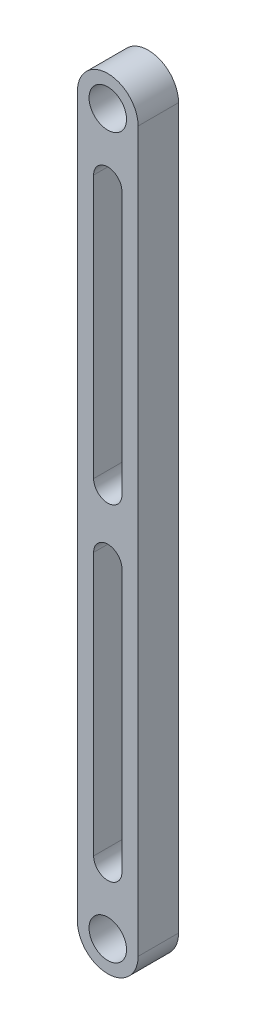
ISO-10303-21;
HEADER;
FILE_DESCRIPTION(('STEP AP214'),'2;1');
FILE_NAME('part.step','',(''),(''),'','','');
FILE_SCHEMA(('AUTOMOTIVE_DESIGN { 1 0 10303 214 1 1 1 1 }'));
ENDSEC;
DATA;
#1=APPLICATION_CONTEXT('core data for automotive mechanical design processes');
#2=APPLICATION_PROTOCOL_DEFINITION('international standard','automotive_design',2000,#1);
#3=PRODUCT_CONTEXT('',#1,'mechanical');
#4=PRODUCT('Part','Part','',(#3));
#5=PRODUCT_RELATED_PRODUCT_CATEGORY('part','',(#4));
#6=PRODUCT_DEFINITION_FORMATION('','',#4);
#7=PRODUCT_DEFINITION_CONTEXT('part definition',#1,'design');
#8=PRODUCT_DEFINITION('design','',#6,#7);
#9=PRODUCT_DEFINITION_SHAPE('','',#8);
#10=(LENGTH_UNIT() NAMED_UNIT(*) SI_UNIT(.MILLI.,.METRE.));
#11=(NAMED_UNIT(*) PLANE_ANGLE_UNIT() SI_UNIT($,.RADIAN.));
#12=(NAMED_UNIT(*) SI_UNIT($,.STERADIAN.) SOLID_ANGLE_UNIT());
#13=UNCERTAINTY_MEASURE_WITH_UNIT(LENGTH_MEASURE(1.E-05),#10,'distance_accuracy_value','');
#14=(GEOMETRIC_REPRESENTATION_CONTEXT(3) GLOBAL_UNCERTAINTY_ASSIGNED_CONTEXT((#13)) GLOBAL_UNIT_ASSIGNED_CONTEXT((#10,
#11,#12)) REPRESENTATION_CONTEXT('',''));
#15=CARTESIAN_POINT('',(0.,0.,0.));
#16=DIRECTION('',(0.,0.,1.));
#17=DIRECTION('',(1.,0.,0.));
#18=AXIS2_PLACEMENT_3D('',#15,#16,#17);
#19=CARTESIAN_POINT('',(0.,-88.9,10.));
#20=DIRECTION('',(0.,0.,1.));
#21=DIRECTION('',(1.,0.,0.));
#22=AXIS2_PLACEMENT_3D('',#19,#20,#21);
#23=PLANE('',#22);
#24=CARTESIAN_POINT('',(0.,-88.9,10.));
#25=DIRECTION('',(0.,0.,1.));
#26=DIRECTION('',(1.,0.,0.));
#27=AXIS2_PLACEMENT_3D('',#24,#25,#26);
#28=CIRCLE('',#27,4.635);
#29=CARTESIAN_POINT('',(4.635,-88.9,10.));
#30=VERTEX_POINT('',#29);
#31=EDGE_CURVE('E196',#30,#30,#28,.T.);
#32=ORIENTED_EDGE('',*,*,#31,.F.);
#33=EDGE_LOOP('',(#32));
#34=FACE_BOUND('',#33,.T.);
#35=CARTESIAN_POINT('',(0.,-88.9,10.));
#36=DIRECTION('',(0.,0.,1.));
#37=DIRECTION('',(1.,0.,0.));
#38=AXIS2_PLACEMENT_3D('',#35,#36,#37);
#39=CIRCLE('',#38,7.5);
#40=CARTESIAN_POINT('',(-7.5,-88.9,10.));
#41=VERTEX_POINT('',#40);
#42=CARTESIAN_POINT('',(7.5,-88.9,10.));
#43=VERTEX_POINT('',#42);
#44=EDGE_CURVE('E202',#41,#43,#39,.T.);
#45=ORIENTED_EDGE('',*,*,#44,.T.);
#46=DIRECTION('',(0.,1.,0.));
#47=VECTOR('',#46,1.);
#48=CARTESIAN_POINT('',(7.5,-88.9,10.));
#49=LINE('',#48,#47);
#50=CARTESIAN_POINT('',(7.5,88.9,10.));
#51=VERTEX_POINT('',#50);
#52=EDGE_CURVE('E205',#43,#51,#49,.T.);
#53=ORIENTED_EDGE('',*,*,#52,.T.);
#54=CARTESIAN_POINT('',(0.,88.9,10.));
#55=DIRECTION('',(0.,0.,1.));
#56=DIRECTION('',(1.,0.,0.));
#57=AXIS2_PLACEMENT_3D('',#54,#55,#56);
#58=CIRCLE('',#57,7.5);
#59=CARTESIAN_POINT('',(-7.50000000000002,88.9,10.));
#60=VERTEX_POINT('',#59);
#61=EDGE_CURVE('E208',#51,#60,#58,.T.);
#62=ORIENTED_EDGE('',*,*,#61,.T.);
#63=DIRECTION('',(0.,-1.,0.));
#64=VECTOR('',#63,1.);
#65=CARTESIAN_POINT('',(-7.5,-88.9,10.));
#66=LINE('',#65,#64);
#67=EDGE_CURVE('E210',#60,#41,#66,.T.);
#68=ORIENTED_EDGE('',*,*,#67,.T.);
#69=EDGE_LOOP('',(#45,#53,#62,#68));
#70=FACE_BOUND('',#69,.T.);
#71=CARTESIAN_POINT('',(0.,88.9,10.));
#72=DIRECTION('',(0.,0.,1.));
#73=DIRECTION('',(1.,0.,0.));
#74=AXIS2_PLACEMENT_3D('',#71,#72,#73);
#75=CIRCLE('',#74,4.635);
#76=CARTESIAN_POINT('',(4.635,88.9,10.));
#77=VERTEX_POINT('',#76);
#78=EDGE_CURVE('E190',#77,#77,#75,.T.);
#79=ORIENTED_EDGE('',*,*,#78,.F.);
#80=EDGE_LOOP('',(#79));
#81=FACE_BOUND('',#80,.T.);
#82=DIRECTION('',(0.,1.,0.));
#83=VECTOR('',#82,1.);
#84=CARTESIAN_POINT('',(3.50000000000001,-72.9,10.));
#85=LINE('',#84,#83);
#86=CARTESIAN_POINT('',(3.50000000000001,-72.9,10.));
#87=VERTEX_POINT('',#86);
#88=CARTESIAN_POINT('',(3.49999999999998,-7.89999999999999,10.));
#89=VERTEX_POINT('',#88);
#90=EDGE_CURVE('E161',#87,#89,#85,.T.);
#91=ORIENTED_EDGE('',*,*,#90,.F.);
#92=CARTESIAN_POINT('',(0.,-72.9,10.));
#93=DIRECTION('',(0.,0.,1.));
#94=DIRECTION('',(1.,0.,0.));
#95=AXIS2_PLACEMENT_3D('',#92,#93,#94);
#96=CIRCLE('',#95,3.5);
#97=CARTESIAN_POINT('',(-3.49999999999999,-72.9,10.));
#98=VERTEX_POINT('',#97);
#99=EDGE_CURVE('E159',#98,#87,#96,.T.);
#100=ORIENTED_EDGE('',*,*,#99,.F.);
#101=DIRECTION('',(0.,-1.,0.));
#102=VECTOR('',#101,1.);
#103=CARTESIAN_POINT('',(-3.49999999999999,-72.9,10.));
#104=LINE('',#103,#102);
#105=CARTESIAN_POINT('',(-3.49999999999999,-7.90000000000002,10.));
#106=VERTEX_POINT('',#105);
#107=EDGE_CURVE('E167',#106,#98,#104,.T.);
#108=ORIENTED_EDGE('',*,*,#107,.F.);
#109=CARTESIAN_POINT('',(0.,-7.90000000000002,10.));
#110=DIRECTION('',(0.,0.,1.));
#111=DIRECTION('',(1.,0.,0.));
#112=AXIS2_PLACEMENT_3D('',#109,#110,#111);
#113=CIRCLE('',#112,3.5);
#114=EDGE_CURVE('E164',#89,#106,#113,.T.);
#115=ORIENTED_EDGE('',*,*,#114,.F.);
#116=EDGE_LOOP('',(#91,#100,#108,#115));
#117=FACE_BOUND('',#116,.T.);
#118=DIRECTION('',(0.,-1.,0.));
#119=VECTOR('',#118,1.);
#120=CARTESIAN_POINT('',(-3.5,72.9,10.));
#121=LINE('',#120,#119);
#122=CARTESIAN_POINT('',(-3.5,72.9,10.));
#123=VERTEX_POINT('',#122);
#124=CARTESIAN_POINT('',(-3.50000000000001,7.9,10.));
#125=VERTEX_POINT('',#124);
#126=EDGE_CURVE('E131',#123,#125,#121,.T.);
#127=ORIENTED_EDGE('',*,*,#126,.F.);
#128=CARTESIAN_POINT('',(0.,72.9,10.));
#129=DIRECTION('',(0.,0.,1.));
#130=DIRECTION('',(1.,0.,0.));
#131=AXIS2_PLACEMENT_3D('',#128,#129,#130);
#132=CIRCLE('',#131,3.50000000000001);
#133=CARTESIAN_POINT('',(3.50000000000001,72.9,10.));
#134=VERTEX_POINT('',#133);
#135=EDGE_CURVE('E123',#134,#123,#132,.T.);
#136=ORIENTED_EDGE('',*,*,#135,.F.);
#137=DIRECTION('',(0.,1.,0.));
#138=VECTOR('',#137,1.);
#139=CARTESIAN_POINT('',(3.50000000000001,72.9,10.));
#140=LINE('',#139,#138);
#141=CARTESIAN_POINT('',(3.50000000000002,7.9,10.));
#142=VERTEX_POINT('',#141);
#143=EDGE_CURVE('E145',#142,#134,#140,.T.);
#144=ORIENTED_EDGE('',*,*,#143,.F.);
#145=CARTESIAN_POINT('',(0.,7.9,10.));
#146=DIRECTION('',(0.,0.,1.));
#147=DIRECTION('',(1.,0.,0.));
#148=AXIS2_PLACEMENT_3D('',#145,#146,#147);
#149=CIRCLE('',#148,3.50000000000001);
#150=EDGE_CURVE('E143',#125,#142,#149,.T.);
#151=ORIENTED_EDGE('',*,*,#150,.F.);
#152=EDGE_LOOP('',(#127,#136,#144,#151));
#153=FACE_BOUND('',#152,.T.);
#154=ADVANCED_FACE('F34',(#34,#70,#81,#117,#153),#23,.T.);
#155=CARTESIAN_POINT('',(0.,-88.9,0.));
#156=DIRECTION('',(0.,0.,1.));
#157=DIRECTION('',(1.,0.,0.));
#158=AXIS2_PLACEMENT_3D('',#155,#156,#157);
#159=PLANE('',#158);
#160=CARTESIAN_POINT('',(0.,-72.9,0.));
#161=DIRECTION('',(0.,0.,1.));
#162=DIRECTION('',(1.,0.,0.));
#163=AXIS2_PLACEMENT_3D('',#160,#161,#162);
#164=CIRCLE('',#163,3.5);
#165=CARTESIAN_POINT('',(-3.49999999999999,-72.9,0.));
#166=VERTEX_POINT('',#165);
#167=CARTESIAN_POINT('',(3.50000000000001,-72.9,0.));
#168=VERTEX_POINT('',#167);
#169=EDGE_CURVE('E139',#166,#168,#164,.T.);
#170=ORIENTED_EDGE('',*,*,#169,.T.);
#171=DIRECTION('',(0.,1.,0.));
#172=VECTOR('',#171,1.);
#173=CARTESIAN_POINT('',(3.50000000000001,-72.9,0.));
#174=LINE('',#173,#172);
#175=CARTESIAN_POINT('',(3.49999999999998,-7.89999999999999,0.));
#176=VERTEX_POINT('',#175);
#177=EDGE_CURVE('E172',#168,#176,#174,.T.);
#178=ORIENTED_EDGE('',*,*,#177,.T.);
#179=CARTESIAN_POINT('',(0.,-7.90000000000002,0.));
#180=DIRECTION('',(0.,0.,1.));
#181=DIRECTION('',(1.,0.,0.));
#182=AXIS2_PLACEMENT_3D('',#179,#180,#181);
#183=CIRCLE('',#182,3.5);
#184=CARTESIAN_POINT('',(-3.49999999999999,-7.90000000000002,0.));
#185=VERTEX_POINT('',#184);
#186=EDGE_CURVE('E175',#176,#185,#183,.T.);
#187=ORIENTED_EDGE('',*,*,#186,.T.);
#188=DIRECTION('',(0.,-1.,0.));
#189=VECTOR('',#188,1.);
#190=CARTESIAN_POINT('',(-3.49999999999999,-72.9,0.));
#191=LINE('',#190,#189);
#192=EDGE_CURVE('E162',#185,#166,#191,.T.);
#193=ORIENTED_EDGE('',*,*,#192,.T.);
#194=EDGE_LOOP('',(#170,#178,#187,#193));
#195=FACE_BOUND('',#194,.T.);
#196=CARTESIAN_POINT('',(0.,-88.9,0.));
#197=DIRECTION('',(0.,0.,1.));
#198=DIRECTION('',(1.,0.,0.));
#199=AXIS2_PLACEMENT_3D('',#196,#197,#198);
#200=CIRCLE('',#199,7.5);
#201=CARTESIAN_POINT('',(-7.5,-88.9,0.));
#202=VERTEX_POINT('',#201);
#203=CARTESIAN_POINT('',(7.5,-88.9,0.));
#204=VERTEX_POINT('',#203);
#205=EDGE_CURVE('E199',#202,#204,#200,.T.);
#206=ORIENTED_EDGE('',*,*,#205,.F.);
#207=DIRECTION('',(0.,-1.,0.));
#208=VECTOR('',#207,1.);
#209=CARTESIAN_POINT('',(-7.5,-88.9,0.));
#210=LINE('',#209,#208);
#211=CARTESIAN_POINT('',(-7.50000000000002,88.9,0.));
#212=VERTEX_POINT('',#211);
#213=EDGE_CURVE('E206',#212,#202,#210,.T.);
#214=ORIENTED_EDGE('',*,*,#213,.F.);
#215=CARTESIAN_POINT('',(0.,88.9,0.));
#216=DIRECTION('',(0.,0.,1.));
#217=DIRECTION('',(1.,0.,0.));
#218=AXIS2_PLACEMENT_3D('',#215,#216,#217);
#219=CIRCLE('',#218,7.5);
#220=CARTESIAN_POINT('',(7.5,88.9,0.));
#221=VERTEX_POINT('',#220);
#222=EDGE_CURVE('E217',#221,#212,#219,.T.);
#223=ORIENTED_EDGE('',*,*,#222,.F.);
#224=DIRECTION('',(0.,1.,0.));
#225=VECTOR('',#224,1.);
#226=CARTESIAN_POINT('',(7.5,-88.9,0.));
#227=LINE('',#226,#225);
#228=EDGE_CURVE('E215',#204,#221,#227,.T.);
#229=ORIENTED_EDGE('',*,*,#228,.F.);
#230=EDGE_LOOP('',(#206,#214,#223,#229));
#231=FACE_BOUND('',#230,.T.);
#232=CARTESIAN_POINT('',(0.,-88.9,0.));
#233=DIRECTION('',(0.,0.,1.));
#234=DIRECTION('',(1.,0.,0.));
#235=AXIS2_PLACEMENT_3D('',#232,#233,#234);
#236=CIRCLE('',#235,4.635);
#237=CARTESIAN_POINT('',(4.635,-88.9,0.));
#238=VERTEX_POINT('',#237);
#239=EDGE_CURVE('E193',#238,#238,#236,.T.);
#240=ORIENTED_EDGE('',*,*,#239,.T.);
#241=EDGE_LOOP('',(#240));
#242=FACE_BOUND('',#241,.T.);
#243=CARTESIAN_POINT('',(0.,88.9,0.));
#244=DIRECTION('',(0.,0.,1.));
#245=DIRECTION('',(1.,0.,0.));
#246=AXIS2_PLACEMENT_3D('',#243,#244,#245);
#247=CIRCLE('',#246,4.635);
#248=CARTESIAN_POINT('',(4.635,88.9,0.));
#249=VERTEX_POINT('',#248);
#250=EDGE_CURVE('E189',#249,#249,#247,.T.);
#251=ORIENTED_EDGE('',*,*,#250,.T.);
#252=EDGE_LOOP('',(#251));
#253=FACE_BOUND('',#252,.T.);
#254=CARTESIAN_POINT('',(0.,72.9,0.));
#255=DIRECTION('',(0.,0.,1.));
#256=DIRECTION('',(1.,0.,0.));
#257=AXIS2_PLACEMENT_3D('',#254,#255,#256);
#258=CIRCLE('',#257,3.50000000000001);
#259=CARTESIAN_POINT('',(3.50000000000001,72.9,0.));
#260=VERTEX_POINT('',#259);
#261=CARTESIAN_POINT('',(-3.5,72.9,0.));
#262=VERTEX_POINT('',#261);
#263=EDGE_CURVE('E57',#260,#262,#258,.T.);
#264=ORIENTED_EDGE('',*,*,#263,.T.);
#265=DIRECTION('',(0.,-1.,0.));
#266=VECTOR('',#265,1.);
#267=CARTESIAN_POINT('',(-3.5,72.9,0.));
#268=LINE('',#267,#266);
#269=CARTESIAN_POINT('',(-3.50000000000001,7.9,0.));
#270=VERTEX_POINT('',#269);
#271=EDGE_CURVE('E138',#262,#270,#268,.T.);
#272=ORIENTED_EDGE('',*,*,#271,.T.);
#273=CARTESIAN_POINT('',(0.,7.9,0.));
#274=DIRECTION('',(0.,0.,1.));
#275=DIRECTION('',(1.,0.,0.));
#276=AXIS2_PLACEMENT_3D('',#273,#274,#275);
#277=CIRCLE('',#276,3.50000000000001);
#278=CARTESIAN_POINT('',(3.50000000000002,7.9,0.));
#279=VERTEX_POINT('',#278);
#280=EDGE_CURVE('E151',#270,#279,#277,.T.);
#281=ORIENTED_EDGE('',*,*,#280,.T.);
#282=DIRECTION('',(0.,1.,0.));
#283=VECTOR('',#282,1.);
#284=CARTESIAN_POINT('',(3.50000000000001,72.9,0.));
#285=LINE('',#284,#283);
#286=EDGE_CURVE('E132',#279,#260,#285,.T.);
#287=ORIENTED_EDGE('',*,*,#286,.T.);
#288=EDGE_LOOP('',(#264,#272,#281,#287));
#289=FACE_BOUND('',#288,.T.);
#290=ADVANCED_FACE('F235',(#195,#231,#242,#253,#289),#159,.F.);
#291=CARTESIAN_POINT('',(0.,-88.9,10.));
#292=DIRECTION('',(0.,0.,-1.));
#293=DIRECTION('',(-1.,0.,0.));
#294=AXIS2_PLACEMENT_3D('',#291,#292,#293);
#295=CYLINDRICAL_SURFACE('',#294,7.5);
#296=ORIENTED_EDGE('',*,*,#205,.T.);
#297=DIRECTION('',(0.,0.,-1.));
#298=VECTOR('',#297,1.);
#299=CARTESIAN_POINT('',(7.5,-88.9,10.));
#300=LINE('',#299,#298);
#301=EDGE_CURVE('E11',#43,#204,#300,.T.);
#302=ORIENTED_EDGE('',*,*,#301,.F.);
#303=ORIENTED_EDGE('',*,*,#44,.F.);
#304=DIRECTION('',(0.,0.,-1.));
#305=VECTOR('',#304,1.);
#306=CARTESIAN_POINT('',(-7.5,-88.9,10.));
#307=LINE('',#306,#305);
#308=EDGE_CURVE('E212',#41,#202,#307,.T.);
#309=ORIENTED_EDGE('',*,*,#308,.T.);
#310=EDGE_LOOP('',(#296,#302,#303,#309));
#311=FACE_BOUND('',#310,.T.);
#312=ADVANCED_FACE('F36',(#311),#295,.T.);
#313=CARTESIAN_POINT('',(7.5,-88.9,10.));
#314=DIRECTION('',(-1.,0.,0.));
#315=DIRECTION('',(0.,-1.,0.));
#316=AXIS2_PLACEMENT_3D('',#313,#314,#315);
#317=PLANE('',#316);
#318=ORIENTED_EDGE('',*,*,#228,.T.);
#319=DIRECTION('',(0.,0.,-1.));
#320=VECTOR('',#319,1.);
#321=CARTESIAN_POINT('',(7.5,88.9,10.));
#322=LINE('',#321,#320);
#323=EDGE_CURVE('E42',#51,#221,#322,.T.);
#324=ORIENTED_EDGE('',*,*,#323,.F.);
#325=ORIENTED_EDGE('',*,*,#52,.F.);
#326=ORIENTED_EDGE('',*,*,#301,.T.);
#327=EDGE_LOOP('',(#318,#324,#325,#326));
#328=FACE_BOUND('',#327,.T.);
#329=ADVANCED_FACE('F246',(#328),#317,.F.);
#330=CARTESIAN_POINT('',(0.,88.9,10.));
#331=DIRECTION('',(0.,0.,-1.));
#332=DIRECTION('',(-1.,0.,0.));
#333=AXIS2_PLACEMENT_3D('',#330,#331,#332);
#334=CYLINDRICAL_SURFACE('',#333,7.5);
#335=ORIENTED_EDGE('',*,*,#222,.T.);
#336=DIRECTION('',(0.,0.,-1.));
#337=VECTOR('',#336,1.);
#338=CARTESIAN_POINT('',(-7.50000000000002,88.9,10.));
#339=LINE('',#338,#337);
#340=EDGE_CURVE('E222',#60,#212,#339,.T.);
#341=ORIENTED_EDGE('',*,*,#340,.F.);
#342=ORIENTED_EDGE('',*,*,#61,.F.);
#343=ORIENTED_EDGE('',*,*,#323,.T.);
#344=EDGE_LOOP('',(#335,#341,#342,#343));
#345=FACE_BOUND('',#344,.T.);
#346=ADVANCED_FACE('F229',(#345),#334,.T.);
#347=CARTESIAN_POINT('',(-7.5,-88.9,10.));
#348=DIRECTION('',(1.,0.,0.));
#349=DIRECTION('',(0.,1.,0.));
#350=AXIS2_PLACEMENT_3D('',#347,#348,#349);
#351=PLANE('',#350);
#352=ORIENTED_EDGE('',*,*,#213,.T.);
#353=ORIENTED_EDGE('',*,*,#308,.F.);
#354=ORIENTED_EDGE('',*,*,#67,.F.);
#355=ORIENTED_EDGE('',*,*,#340,.T.);
#356=EDGE_LOOP('',(#352,#353,#354,#355));
#357=FACE_BOUND('',#356,.T.);
#358=ADVANCED_FACE('F239',(#357),#351,.F.);
#359=CARTESIAN_POINT('',(0.,-88.9,10.));
#360=DIRECTION('',(0.,0.,-1.));
#361=DIRECTION('',(-1.,0.,0.));
#362=AXIS2_PLACEMENT_3D('',#359,#360,#361);
#363=CYLINDRICAL_SURFACE('',#362,4.635);
#364=ORIENTED_EDGE('',*,*,#31,.T.);
#365=EDGE_LOOP('',(#364));
#366=FACE_BOUND('',#365,.T.);
#367=ORIENTED_EDGE('',*,*,#239,.F.);
#368=EDGE_LOOP('',(#367));
#369=FACE_BOUND('',#368,.T.);
#370=ADVANCED_FACE('F263',(#366,#369),#363,.F.);
#371=CARTESIAN_POINT('',(0.,88.9,10.));
#372=DIRECTION('',(0.,0.,-1.));
#373=DIRECTION('',(-1.,0.,0.));
#374=AXIS2_PLACEMENT_3D('',#371,#372,#373);
#375=CYLINDRICAL_SURFACE('',#374,4.635);
#376=ORIENTED_EDGE('',*,*,#78,.T.);
#377=EDGE_LOOP('',(#376));
#378=FACE_BOUND('',#377,.T.);
#379=ORIENTED_EDGE('',*,*,#250,.F.);
#380=EDGE_LOOP('',(#379));
#381=FACE_BOUND('',#380,.T.);
#382=ADVANCED_FACE('F270',(#378,#381),#375,.F.);
#383=CARTESIAN_POINT('',(0.,-72.9,10.));
#384=DIRECTION('',(0.,0.,-1.));
#385=DIRECTION('',(-1.,0.,0.));
#386=AXIS2_PLACEMENT_3D('',#383,#384,#385);
#387=CYLINDRICAL_SURFACE('',#386,3.5);
#388=ORIENTED_EDGE('',*,*,#169,.F.);
#389=DIRECTION('',(0.,0.,-1.));
#390=VECTOR('',#389,1.);
#391=CARTESIAN_POINT('',(-3.49999999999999,-72.9,10.));
#392=LINE('',#391,#390);
#393=EDGE_CURVE('E169',#98,#166,#392,.T.);
#394=ORIENTED_EDGE('',*,*,#393,.F.);
#395=ORIENTED_EDGE('',*,*,#99,.T.);
#396=DIRECTION('',(0.,0.,-1.));
#397=VECTOR('',#396,1.);
#398=CARTESIAN_POINT('',(3.50000000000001,-72.9,10.));
#399=LINE('',#398,#397);
#400=EDGE_CURVE('E186',#87,#168,#399,.T.);
#401=ORIENTED_EDGE('',*,*,#400,.T.);
#402=EDGE_LOOP('',(#388,#394,#395,#401));
#403=FACE_BOUND('',#402,.T.);
#404=ADVANCED_FACE('F275',(#403),#387,.F.);
#405=CARTESIAN_POINT('',(3.50000000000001,-72.9,10.));
#406=DIRECTION('',(-1.,0.,0.));
#407=DIRECTION('',(0.,0.,1.));
#408=AXIS2_PLACEMENT_3D('',#405,#406,#407);
#409=PLANE('',#408);
#410=ORIENTED_EDGE('',*,*,#177,.F.);
#411=ORIENTED_EDGE('',*,*,#400,.F.);
#412=ORIENTED_EDGE('',*,*,#90,.T.);
#413=DIRECTION('',(0.,0.,-1.));
#414=VECTOR('',#413,1.);
#415=CARTESIAN_POINT('',(3.49999999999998,-7.89999999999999,10.));
#416=LINE('',#415,#414);
#417=EDGE_CURVE('E184',#89,#176,#416,.T.);
#418=ORIENTED_EDGE('',*,*,#417,.T.);
#419=EDGE_LOOP('',(#410,#411,#412,#418));
#420=FACE_BOUND('',#419,.T.);
#421=ADVANCED_FACE('F304',(#420),#409,.T.);
#422=CARTESIAN_POINT('',(0.,-7.90000000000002,10.));
#423=DIRECTION('',(0.,0.,-1.));
#424=DIRECTION('',(-1.,0.,0.));
#425=AXIS2_PLACEMENT_3D('',#422,#423,#424);
#426=CYLINDRICAL_SURFACE('',#425,3.5);
#427=ORIENTED_EDGE('',*,*,#186,.F.);
#428=ORIENTED_EDGE('',*,*,#417,.F.);
#429=ORIENTED_EDGE('',*,*,#114,.T.);
#430=DIRECTION('',(0.,0.,-1.));
#431=VECTOR('',#430,1.);
#432=CARTESIAN_POINT('',(-3.49999999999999,-7.90000000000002,10.));
#433=LINE('',#432,#431);
#434=EDGE_CURVE('E182',#106,#185,#433,.T.);
#435=ORIENTED_EDGE('',*,*,#434,.T.);
#436=EDGE_LOOP('',(#427,#428,#429,#435));
#437=FACE_BOUND('',#436,.T.);
#438=ADVANCED_FACE('F300',(#437),#426,.F.);
#439=CARTESIAN_POINT('',(-3.49999999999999,-72.9,10.));
#440=DIRECTION('',(1.,0.,0.));
#441=DIRECTION('',(0.,0.,-1.));
#442=AXIS2_PLACEMENT_3D('',#439,#440,#441);
#443=PLANE('',#442);
#444=ORIENTED_EDGE('',*,*,#192,.F.);
#445=ORIENTED_EDGE('',*,*,#434,.F.);
#446=ORIENTED_EDGE('',*,*,#107,.T.);
#447=ORIENTED_EDGE('',*,*,#393,.T.);
#448=EDGE_LOOP('',(#444,#445,#446,#447));
#449=FACE_BOUND('',#448,.T.);
#450=ADVANCED_FACE('F297',(#449),#443,.T.);
#451=CARTESIAN_POINT('',(0.,72.9,10.));
#452=DIRECTION('',(0.,0.,-1.));
#453=DIRECTION('',(-1.,0.,0.));
#454=AXIS2_PLACEMENT_3D('',#451,#452,#453);
#455=CYLINDRICAL_SURFACE('',#454,3.50000000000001);
#456=ORIENTED_EDGE('',*,*,#263,.F.);
#457=DIRECTION('',(0.,0.,-1.));
#458=VECTOR('',#457,1.);
#459=CARTESIAN_POINT('',(3.50000000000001,72.9,10.));
#460=LINE('',#459,#458);
#461=EDGE_CURVE('E127',#134,#260,#460,.T.);
#462=ORIENTED_EDGE('',*,*,#461,.F.);
#463=ORIENTED_EDGE('',*,*,#135,.T.);
#464=DIRECTION('',(0.,0.,-1.));
#465=VECTOR('',#464,1.);
#466=CARTESIAN_POINT('',(-3.5,72.9,10.));
#467=LINE('',#466,#465);
#468=EDGE_CURVE('E126',#123,#262,#467,.T.);
#469=ORIENTED_EDGE('',*,*,#468,.T.);
#470=EDGE_LOOP('',(#456,#462,#463,#469));
#471=FACE_BOUND('',#470,.T.);
#472=ADVANCED_FACE('F125',(#471),#455,.F.);
#473=CARTESIAN_POINT('',(-3.5,72.9,10.));
#474=DIRECTION('',(1.,0.,0.));
#475=DIRECTION('',(0.,0.,-1.));
#476=AXIS2_PLACEMENT_3D('',#473,#474,#475);
#477=PLANE('',#476);
#478=ORIENTED_EDGE('',*,*,#271,.F.);
#479=ORIENTED_EDGE('',*,*,#468,.F.);
#480=ORIENTED_EDGE('',*,*,#126,.T.);
#481=DIRECTION('',(0.,0.,-1.));
#482=VECTOR('',#481,1.);
#483=CARTESIAN_POINT('',(-3.50000000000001,7.9,10.));
#484=LINE('',#483,#482);
#485=EDGE_CURVE('E140',#125,#270,#484,.T.);
#486=ORIENTED_EDGE('',*,*,#485,.T.);
#487=EDGE_LOOP('',(#478,#479,#480,#486));
#488=FACE_BOUND('',#487,.T.);
#489=ADVANCED_FACE('F135',(#488),#477,.T.);
#490=CARTESIAN_POINT('',(0.,7.9,10.));
#491=DIRECTION('',(0.,0.,-1.));
#492=DIRECTION('',(-1.,0.,0.));
#493=AXIS2_PLACEMENT_3D('',#490,#491,#492);
#494=CYLINDRICAL_SURFACE('',#493,3.50000000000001);
#495=ORIENTED_EDGE('',*,*,#280,.F.);
#496=ORIENTED_EDGE('',*,*,#485,.F.);
#497=ORIENTED_EDGE('',*,*,#150,.T.);
#498=DIRECTION('',(0.,0.,-1.));
#499=VECTOR('',#498,1.);
#500=CARTESIAN_POINT('',(3.50000000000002,7.9,10.));
#501=LINE('',#500,#499);
#502=EDGE_CURVE('E49',#142,#279,#501,.T.);
#503=ORIENTED_EDGE('',*,*,#502,.T.);
#504=EDGE_LOOP('',(#495,#496,#497,#503));
#505=FACE_BOUND('',#504,.T.);
#506=ADVANCED_FACE('F285',(#505),#494,.F.);
#507=CARTESIAN_POINT('',(3.50000000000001,72.9,10.));
#508=DIRECTION('',(-1.,0.,0.));
#509=DIRECTION('',(0.,-1.,0.));
#510=AXIS2_PLACEMENT_3D('',#507,#508,#509);
#511=PLANE('',#510);
#512=ORIENTED_EDGE('',*,*,#286,.F.);
#513=ORIENTED_EDGE('',*,*,#502,.F.);
#514=ORIENTED_EDGE('',*,*,#143,.T.);
#515=ORIENTED_EDGE('',*,*,#461,.T.);
#516=EDGE_LOOP('',(#512,#513,#514,#515));
#517=FACE_BOUND('',#516,.T.);
#518=ADVANCED_FACE('F283',(#517),#511,.T.);
#519=CLOSED_SHELL('',(#154,#290,#312,#329,#346,#358,#370,#382,#404,#421,#438,#450,#472,#489,
#506,#518));
#520=MANIFOLD_SOLID_BREP('B2',#519);
#521=ADVANCED_BREP_SHAPE_REPRESENTATION('',(#18,#520),#14);
#522=SHAPE_DEFINITION_REPRESENTATION(#9,#521);
ENDSEC;
END-ISO-10303-21;
